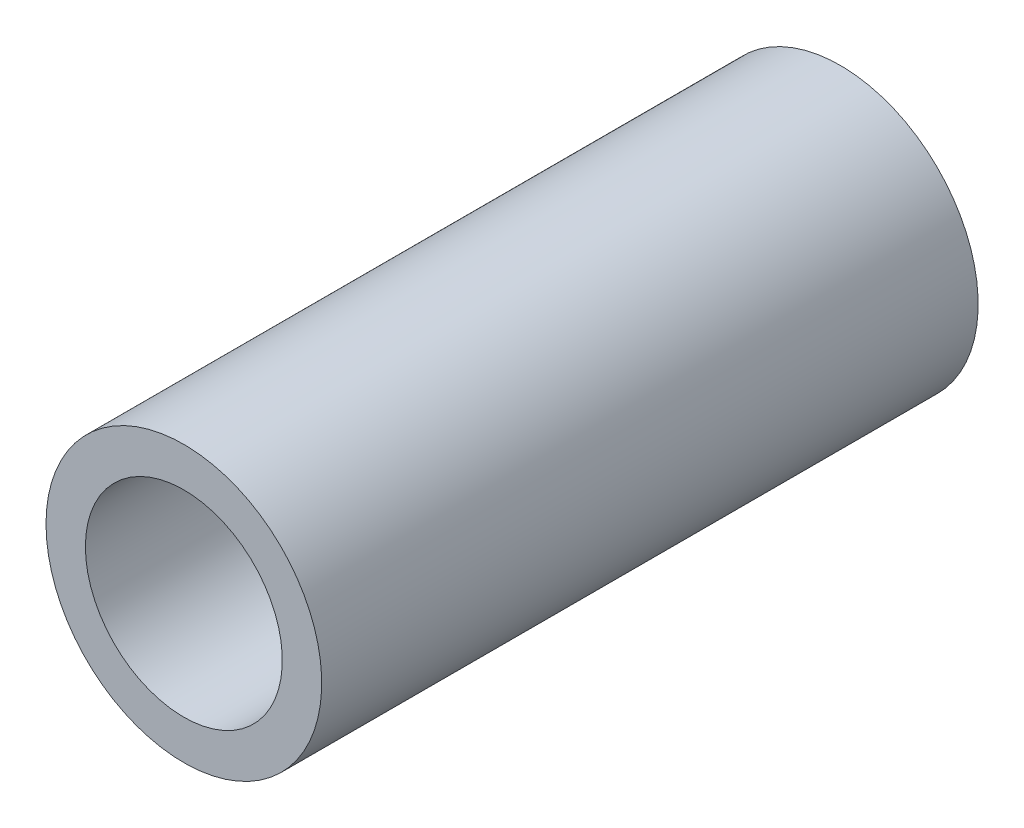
from build123d import *

# Parameters (mm, degrees)
ESQUISSE1_R        = 21
ESQUISSE1_R_2      = 15
EXTRU_MINCE1_DEPTH = 100


with BuildPart() as part:
    # Esquisse1 → Extru.-Mince1 (new body)
    with BuildSketch(Plane.XY):
        Circle(ESQUISSE1_R)
        Circle(ESQUISSE1_R_2, mode=Mode.SUBTRACT)
    extrude(amount=EXTRU_MINCE1_DEPTH)


solid = part.part
